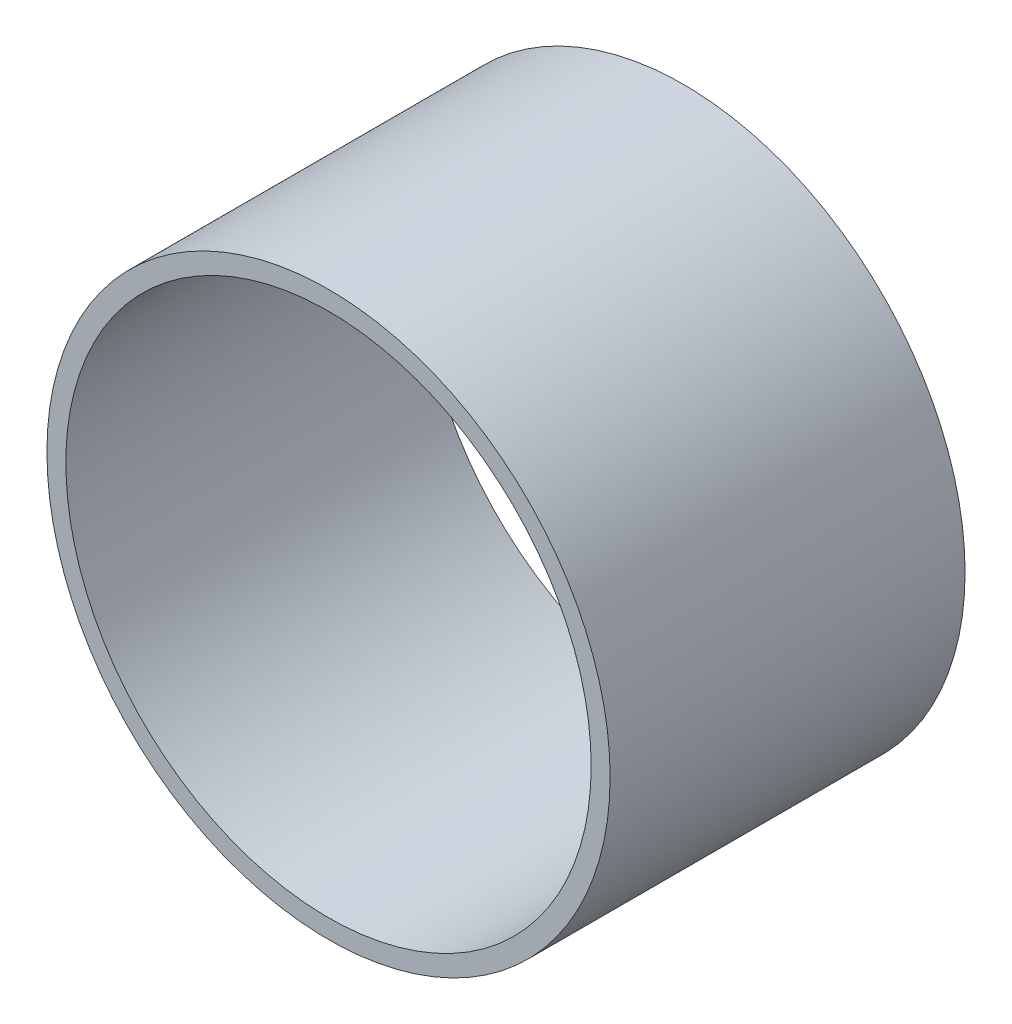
ISO-10303-21;
HEADER;
FILE_DESCRIPTION(('STEP AP214'),'2;1');
FILE_NAME('part.step','',(''),(''),'','','');
FILE_SCHEMA(('AUTOMOTIVE_DESIGN { 1 0 10303 214 1 1 1 1 }'));
ENDSEC;
DATA;
#1=APPLICATION_CONTEXT('core data for automotive mechanical design processes');
#2=APPLICATION_PROTOCOL_DEFINITION('international standard','automotive_design',2000,#1);
#3=PRODUCT_CONTEXT('',#1,'mechanical');
#4=PRODUCT('Part','Part','',(#3));
#5=PRODUCT_RELATED_PRODUCT_CATEGORY('part','',(#4));
#6=PRODUCT_DEFINITION_FORMATION('','',#4);
#7=PRODUCT_DEFINITION_CONTEXT('part definition',#1,'design');
#8=PRODUCT_DEFINITION('design','',#6,#7);
#9=PRODUCT_DEFINITION_SHAPE('','',#8);
#10=(LENGTH_UNIT() NAMED_UNIT(*) SI_UNIT(.MILLI.,.METRE.));
#11=(NAMED_UNIT(*) PLANE_ANGLE_UNIT() SI_UNIT($,.RADIAN.));
#12=(NAMED_UNIT(*) SI_UNIT($,.STERADIAN.) SOLID_ANGLE_UNIT());
#13=UNCERTAINTY_MEASURE_WITH_UNIT(LENGTH_MEASURE(1.E-05),#10,'distance_accuracy_value','');
#14=(GEOMETRIC_REPRESENTATION_CONTEXT(3) GLOBAL_UNCERTAINTY_ASSIGNED_CONTEXT((#13)) GLOBAL_UNIT_ASSIGNED_CONTEXT((#10,
#11,#12)) REPRESENTATION_CONTEXT('',''));
#15=CARTESIAN_POINT('',(0.,0.,0.));
#16=DIRECTION('',(0.,0.,1.));
#17=DIRECTION('',(1.,0.,0.));
#18=AXIS2_PLACEMENT_3D('',#15,#16,#17);
#19=CARTESIAN_POINT('',(0.,0.,15.));
#20=DIRECTION('',(0.,0.,1.));
#21=DIRECTION('',(1.,0.,0.));
#22=AXIS2_PLACEMENT_3D('',#19,#20,#21);
#23=PLANE('',#22);
#24=CARTESIAN_POINT('',(0.,0.,15.));
#25=DIRECTION('',(0.,0.,1.));
#26=DIRECTION('',(1.,0.,0.));
#27=AXIS2_PLACEMENT_3D('',#24,#25,#26);
#28=CIRCLE('',#27,11.9);
#29=CARTESIAN_POINT('',(11.9,0.,15.));
#30=VERTEX_POINT('',#29);
#31=EDGE_CURVE('E10',#30,#30,#28,.T.);
#32=ORIENTED_EDGE('',*,*,#31,.T.);
#33=EDGE_LOOP('',(#32));
#34=FACE_BOUND('',#33,.T.);
#35=CARTESIAN_POINT('',(0.,0.,15.));
#36=DIRECTION('',(0.,0.,1.));
#37=DIRECTION('',(1.,0.,0.));
#38=AXIS2_PLACEMENT_3D('',#35,#36,#37);
#39=CIRCLE('',#38,11.1);
#40=CARTESIAN_POINT('',(11.1,0.,15.));
#41=VERTEX_POINT('',#40);
#42=EDGE_CURVE('E37',#41,#41,#39,.T.);
#43=ORIENTED_EDGE('',*,*,#42,.F.);
#44=EDGE_LOOP('',(#43));
#45=FACE_BOUND('',#44,.T.);
#46=ADVANCED_FACE('F26',(#34,#45),#23,.T.);
#47=CARTESIAN_POINT('',(0.,0.,0.));
#48=DIRECTION('',(0.,0.,1.));
#49=DIRECTION('',(1.,0.,0.));
#50=AXIS2_PLACEMENT_3D('',#47,#48,#49);
#51=PLANE('',#50);
#52=CARTESIAN_POINT('',(0.,0.,0.));
#53=DIRECTION('',(0.,0.,1.));
#54=DIRECTION('',(1.,0.,0.));
#55=AXIS2_PLACEMENT_3D('',#52,#53,#54);
#56=CIRCLE('',#55,11.9);
#57=CARTESIAN_POINT('',(11.9,0.,0.));
#58=VERTEX_POINT('',#57);
#59=EDGE_CURVE('E33',#58,#58,#56,.T.);
#60=ORIENTED_EDGE('',*,*,#59,.F.);
#61=EDGE_LOOP('',(#60));
#62=FACE_BOUND('',#61,.T.);
#63=CARTESIAN_POINT('',(0.,0.,0.));
#64=DIRECTION('',(0.,0.,1.));
#65=DIRECTION('',(1.,0.,0.));
#66=AXIS2_PLACEMENT_3D('',#63,#64,#65);
#67=CIRCLE('',#66,11.1);
#68=CARTESIAN_POINT('',(11.1,0.,0.));
#69=VERTEX_POINT('',#68);
#70=EDGE_CURVE('E41',#69,#69,#67,.T.);
#71=ORIENTED_EDGE('',*,*,#70,.T.);
#72=EDGE_LOOP('',(#71));
#73=FACE_BOUND('',#72,.T.);
#74=ADVANCED_FACE('F47',(#62,#73),#51,.F.);
#75=CARTESIAN_POINT('',(0.,0.,15.));
#76=DIRECTION('',(0.,0.,-1.));
#77=DIRECTION('',(-1.,0.,0.));
#78=AXIS2_PLACEMENT_3D('',#75,#76,#77);
#79=CYLINDRICAL_SURFACE('',#78,11.9);
#80=ORIENTED_EDGE('',*,*,#31,.F.);
#81=EDGE_LOOP('',(#80));
#82=FACE_BOUND('',#81,.T.);
#83=ORIENTED_EDGE('',*,*,#59,.T.);
#84=EDGE_LOOP('',(#83));
#85=FACE_BOUND('',#84,.T.);
#86=ADVANCED_FACE('F28',(#82,#85),#79,.T.);
#87=CARTESIAN_POINT('',(0.,0.,15.));
#88=DIRECTION('',(0.,0.,-1.));
#89=DIRECTION('',(-1.,0.,0.));
#90=AXIS2_PLACEMENT_3D('',#87,#88,#89);
#91=CYLINDRICAL_SURFACE('',#90,11.1);
#92=ORIENTED_EDGE('',*,*,#42,.T.);
#93=EDGE_LOOP('',(#92));
#94=FACE_BOUND('',#93,.T.);
#95=ORIENTED_EDGE('',*,*,#70,.F.);
#96=EDGE_LOOP('',(#95));
#97=FACE_BOUND('',#96,.T.);
#98=ADVANCED_FACE('F49',(#94,#97),#91,.F.);
#99=CLOSED_SHELL('',(#46,#74,#86,#98));
#100=MANIFOLD_SOLID_BREP('B2',#99);
#101=ADVANCED_BREP_SHAPE_REPRESENTATION('',(#18,#100),#14);
#102=SHAPE_DEFINITION_REPRESENTATION(#9,#101);
ENDSEC;
END-ISO-10303-21;
